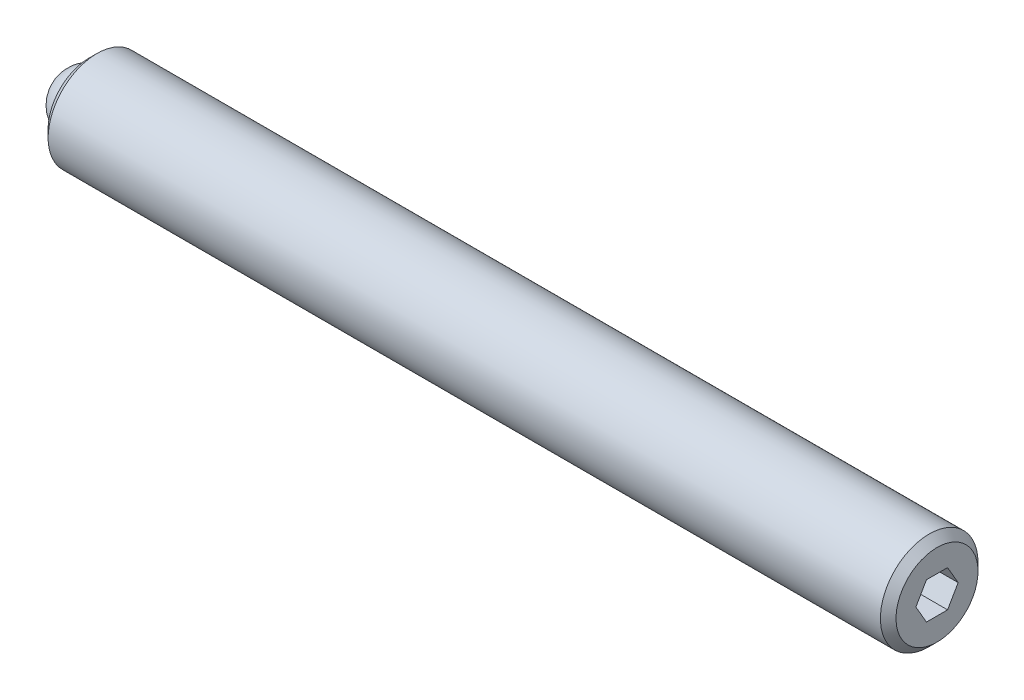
from build123d import *

# Parameters (mm, degrees)
SKETCH2_R           = 3.175
BOSS_EXTRUDE1_DEPTH = 55.165625
CHAMFER1_SIZE       = 0.508
CHAMFER2_SIZE       = 0.508
CUT_EXTRUDE2_DEPTH  = 2.286
SKETCH3_R           = 1.9812
CUT_EXTRUDE3_DEPTH  = 1.984375


with BuildPart() as part:
    # Sketch2 → Boss-Extrude1 (new body)
    with BuildSketch(Plane(origin=(0, 0, 0), x_dir=(0, 0, -1), z_dir=(1, 0, 0))):
        Circle(SKETCH2_R)
    extrude(amount=BOSS_EXTRUDE1_DEPTH)

    # Chamfer1
    chamfer1_edges = [part.edges().sort_by_distance(p)[0] for p in [
        (0, 0, 3.175),
    ]]
    chamfer(chamfer1_edges, length=CHAMFER1_SIZE)

    # Chamfer2
    chamfer2_edges = [part.edges().sort_by_distance(p)[0] for p in [
        (55.165625, 0, 3.175),
    ]]
    chamfer(chamfer2_edges, length=CHAMFER2_SIZE)

    # Sketch4 → Cut-Extrude2 (cut)
    with BuildSketch(Plane(origin=(55.165625, 0, 0), x_dir=(0, 0, -1), z_dir=(1, 0, 0))):
        Polygon((1.374815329, 0), (0.687407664, 1.190625), (-0.687407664, 1.190625), (-1.374815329, 0), (-0.687407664, -1.190625), (0.687407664, -1.190625), align=None)
    extrude(amount=-CUT_EXTRUDE2_DEPTH, mode=Mode.SUBTRACT)

    # Sketch3 → Cut-Extrude3 (cut)
    with BuildSketch(Plane.ZY):
        Circle(SKETCH3_R)
    extrude(amount=-CUT_EXTRUDE3_DEPTH, mode=Mode.SUBTRACT)


with BuildPart() as body_2:
    # Sketch5 → Revolve1 (revolve)
    with BuildSketch(Plane.ZY):
        with BuildLine():
            Line((0, 0), (0, -1.984375))
            ThreePointArc((0, -1.984375), (-1.984375, 0), (0, 1.984375))
            Line((0, 1.984375), (0, 0))
        make_face()
    revolve(axis=Axis((0, 0, 0), (0, 1, 0)))


solid = Compound([part.part, body_2.part])
